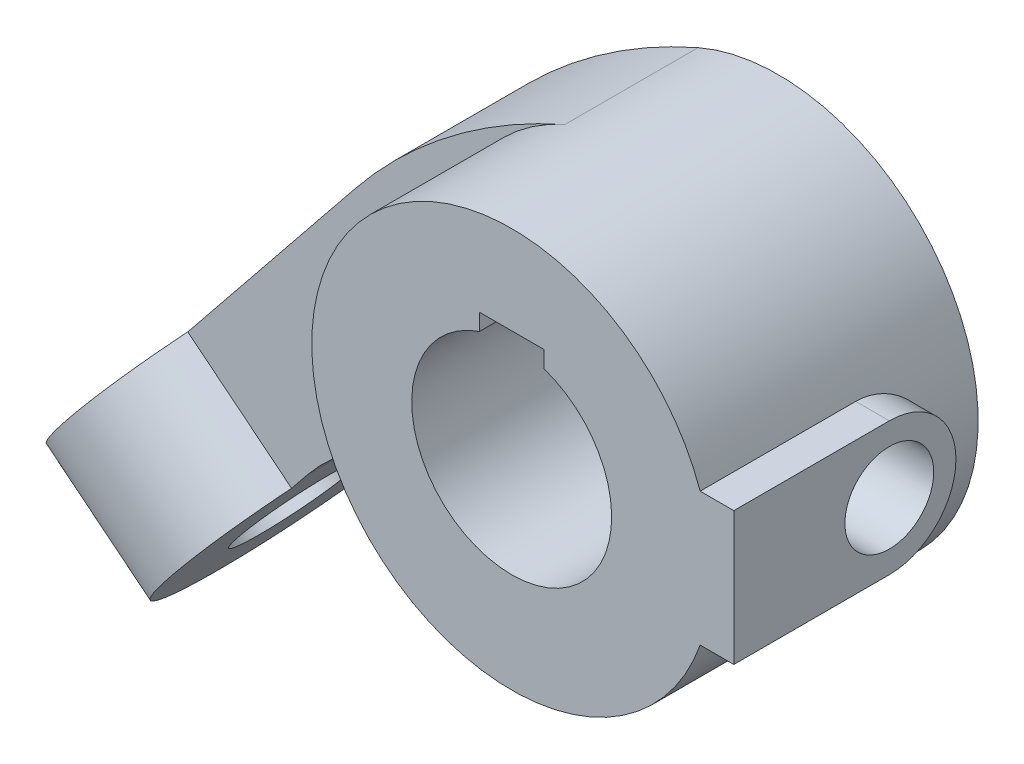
from build123d import *

# Parameters (mm, degrees)
SKETCH_1_R           = 18
EXTRUDE_1_DEPTH      = 24
EXTRUDE_2_DEPTH      = 12
SKETCH_3_R           = 11
EXTRUDE_3_DEPTH      = 12
SKETCH_4_R           = 5
CUT_EXTRUDE_1_DEPTH  = 70.541932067
EXTRUDE_4_REACH      = 89.306
EXTRUDE_4_END_RADIUS = 18
SKETCH_5_R           = 4
CUT_EXTRUDE_2_REACH  = 89.306
SKETCH_6_R           = 4


with BuildPart() as part:
    # Sketch 1 → Extrude 1 (new body)
    with BuildSketch(Plane.XY):
        Circle(SKETCH_1_R)
        with BuildLine():
            Line((-2.900727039, 8.519729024), (-2.900727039, 10.019729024))
            Line((-2.900727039, 10.019729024), (2.900727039, 10.019729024))
            Line((2.900727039, 10.019729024), (2.900727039, 8.519729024))
            ThreePointArc((2.900727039, 8.519729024), (0, -9), (-2.900727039, 8.519729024))
        make_face(mode=Mode.SUBTRACT)
    extrude(amount=EXTRUDE_1_DEPTH)

    # Sketch 2 → Extrude 2 (add)
    with BuildSketch(Plane(origin=(0, 0, 0), x_dir=(-1, 0, 0), z_dir=(0, 0, -1))):
        with BuildLine():
            Line((41.431511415, -16.980657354), (26.104126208, 2.050220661))
            ThreePointArc((26.104126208, 2.050220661), (17.53284102, 10.407747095), (7.220594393, 16.48826906))
            ThreePointArc((7.220594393, 16.48826906), (17.999701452, -0.103670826), (7.030190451, -16.570347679))
            ThreePointArc((7.030190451, -16.570347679), (19.707457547, -15.58280942), (30.41780856, -22.436765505))
            Line((30.41780856, -22.436765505), (37.743137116, -31.532082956))
            Line((37.743137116, -31.532082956), (47.088914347, -24.005035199))
            Line((47.088914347, -24.005035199), (41.431511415, -16.980657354))
        make_face()
    extrude(amount=-EXTRUDE_2_DEPTH)

    # Sketch 3 → Extrude 3 (add)
    with BuildSketch(Plane(origin=(-7.489307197, 6.031854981, 0), x_dir=(0, 0, -1), z_dir=(0.7788147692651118, -0.6272539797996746, 0))):
        with Locations((-6, -48)):
            Circle(SKETCH_3_R)
    extrude(amount=-EXTRUDE_3_DEPTH)

    # Sketch 4 → Cut-Extrude 1 (cut, through all)
    with BuildSketch(Plane(origin=(-7.489307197, 6.031854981, 0), x_dir=(0, 0, -1), z_dir=(0.7788147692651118, -0.6272539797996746, 0))):
        with Locations(Location((-6, -48, 0), (0, 0, 90))):
            Circle(SKETCH_4_R)
    extrude(amount=-CUT_EXTRUDE_1_DEPTH, mode=Mode.SUBTRACT)

    # Extrude 4: up to this cylinder (the profile starts outside it)
    extrude_4_end = Plane(origin=(0, 0, 15.921397), z_dir=(0, 0, -1)) * Cylinder(EXTRUDE_4_END_RADIUS, 215.612, mode=Mode.PRIVATE)
    # Sketch 5 → Extrude 4 (add, up to the surface)
    with BuildSketch(Plane(origin=(20, 0, 0), x_dir=(0, 0, -1), z_dir=(1, 0, 0)), mode=Mode.PRIVATE) as extrude_4_sk1:
        with BuildLine():
            Line((-10, 6), (-24, 6))
            Line((-24, 6), (-24, -6))
            Line((-24, -6), (-10, -6))
            ThreePointArc((-10, -6), (-4, 0), (-10, 6))
        make_face()
        with Locations((-10, 0)):
            Circle(SKETCH_5_R, mode=Mode.SUBTRACT)
    extrude_4_tool1 = extrude(extrude_4_sk1.sketch, amount=-EXTRUDE_4_REACH, mode=Mode.PRIVATE) - extrude_4_end
    add(extrude_4_tool1.solids().sort_by_distance((20, 0, 15.921397))[0])

    # Sketch 6 → Cut-Extrude 2 (cut, up to next)
    with BuildSketch(Plane(origin=(20, 0, 0), x_dir=(0, 0, -1), z_dir=(1, 0, 0)), mode=Mode.PRIVATE) as cut_extrude_2_sk1:
        with Locations((-10, 0)):
            Circle(SKETCH_6_R)
    cut_extrude_2_tool1 = extrude(cut_extrude_2_sk1.sketch, amount=-CUT_EXTRUDE_2_REACH, mode=Mode.PRIVATE) & part.part
    add(cut_extrude_2_tool1.solids().sort_by_distance((20, 0, 10))[0], mode=Mode.SUBTRACT)


solid = part.part
